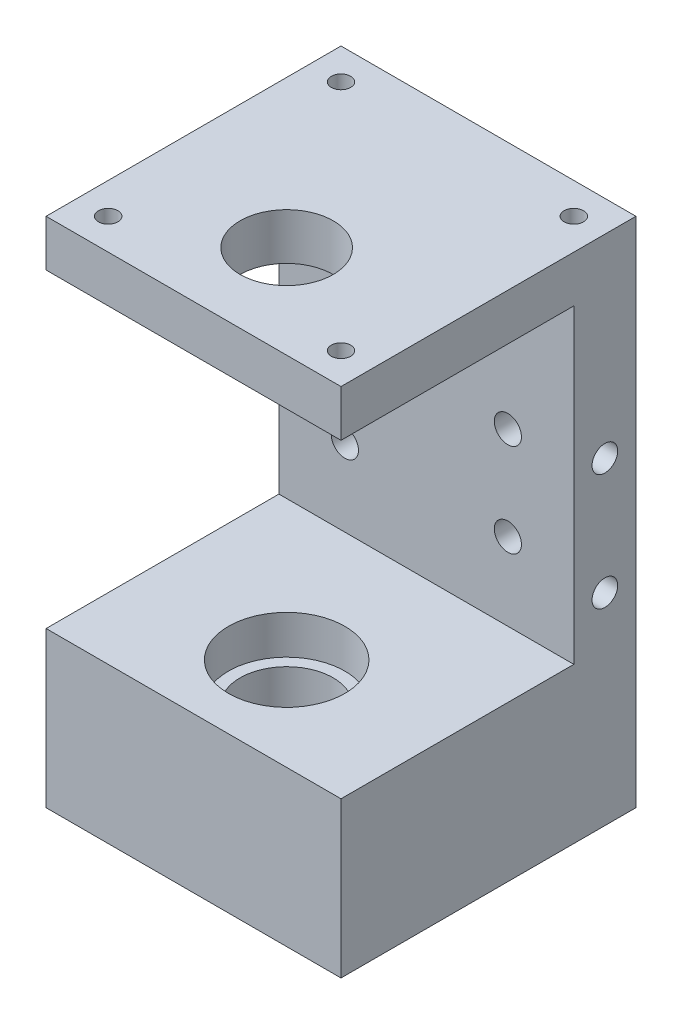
ISO-10303-21;
HEADER;
FILE_DESCRIPTION(('STEP AP214'),'2;1');
FILE_NAME('part.step','',(''),(''),'','','');
FILE_SCHEMA(('AUTOMOTIVE_DESIGN { 1 0 10303 214 1 1 1 1 }'));
ENDSEC;
DATA;
#1=APPLICATION_CONTEXT('core data for automotive mechanical design processes');
#2=APPLICATION_PROTOCOL_DEFINITION('international standard','automotive_design',2000,#1);
#3=PRODUCT_CONTEXT('',#1,'mechanical');
#4=PRODUCT('Part','Part','',(#3));
#5=PRODUCT_RELATED_PRODUCT_CATEGORY('part','',(#4));
#6=PRODUCT_DEFINITION_FORMATION('','',#4);
#7=PRODUCT_DEFINITION_CONTEXT('part definition',#1,'design');
#8=PRODUCT_DEFINITION('design','',#6,#7);
#9=PRODUCT_DEFINITION_SHAPE('','',#8);
#10=(LENGTH_UNIT() NAMED_UNIT(*) SI_UNIT(.MILLI.,.METRE.));
#11=(NAMED_UNIT(*) PLANE_ANGLE_UNIT() SI_UNIT($,.RADIAN.));
#12=(NAMED_UNIT(*) SI_UNIT($,.STERADIAN.) SOLID_ANGLE_UNIT());
#13=UNCERTAINTY_MEASURE_WITH_UNIT(LENGTH_MEASURE(1.E-05),#10,'distance_accuracy_value','');
#14=(GEOMETRIC_REPRESENTATION_CONTEXT(3) GLOBAL_UNCERTAINTY_ASSIGNED_CONTEXT((#13)) GLOBAL_UNIT_ASSIGNED_CONTEXT((#10,
#11,#12)) REPRESENTATION_CONTEXT('',''));
#15=CARTESIAN_POINT('',(0.,0.,0.));
#16=DIRECTION('',(0.,0.,1.));
#17=DIRECTION('',(1.,0.,0.));
#18=AXIS2_PLACEMENT_3D('',#15,#16,#17);
#19=CARTESIAN_POINT('',(0.,-60.,7.));
#20=DIRECTION('',(0.,1.,0.));
#21=DIRECTION('',(0.,0.,1.));
#22=AXIS2_PLACEMENT_3D('',#19,#20,#21);
#23=CYLINDRICAL_SURFACE('',#22,6.);
#24=CARTESIAN_POINT('',(0.,-45.,7.));
#25=DIRECTION('',(0.,1.,0.));
#26=DIRECTION('',(0.,0.,1.));
#27=AXIS2_PLACEMENT_3D('',#24,#25,#26);
#28=CIRCLE('',#27,6.);
#29=CARTESIAN_POINT('',(0.,-45.,13.));
#30=VERTEX_POINT('',#29);
#31=EDGE_CURVE('E20',#30,#30,#28,.F.);
#32=ORIENTED_EDGE('',*,*,#31,.F.);
#33=EDGE_LOOP('',(#32));
#34=FACE_BOUND('',#33,.T.);
#35=CARTESIAN_POINT('',(0.,-55.,7.));
#36=DIRECTION('',(0.,1.,0.));
#37=DIRECTION('',(0.,0.,1.));
#38=AXIS2_PLACEMENT_3D('',#35,#36,#37);
#39=CIRCLE('',#38,6.);
#40=CARTESIAN_POINT('',(0.,-55.,13.));
#41=VERTEX_POINT('',#40);
#42=EDGE_CURVE('E415',#41,#41,#39,.T.);
#43=ORIENTED_EDGE('',*,*,#42,.F.);
#44=EDGE_LOOP('',(#43));
#45=FACE_BOUND('',#44,.T.);
#46=ADVANCED_FACE('F17',(#34,#45),#23,.F.);
#47=CARTESIAN_POINT('',(0.,-45.,7.));
#48=DIRECTION('',(0.,1.,0.));
#49=DIRECTION('',(0.,0.,1.));
#50=AXIS2_PLACEMENT_3D('',#47,#48,#49);
#51=PLANE('',#50);
#52=ORIENTED_EDGE('',*,*,#31,.T.);
#53=EDGE_LOOP('',(#52));
#54=FACE_BOUND('',#53,.T.);
#55=CARTESIAN_POINT('',(0.,-45.,7.));
#56=DIRECTION('',(0.,1.,0.));
#57=DIRECTION('',(0.,0.,1.));
#58=AXIS2_PLACEMENT_3D('',#55,#56,#57);
#59=CIRCLE('',#58,7.5);
#60=CARTESIAN_POINT('',(0.,-45.,14.5));
#61=VERTEX_POINT('',#60);
#62=EDGE_CURVE('E413',#61,#61,#59,.T.);
#63=ORIENTED_EDGE('',*,*,#62,.T.);
#64=EDGE_LOOP('',(#63));
#65=FACE_BOUND('',#64,.T.);
#66=ADVANCED_FACE('F400',(#54,#65),#51,.T.);
#67=CARTESIAN_POINT('',(0.,-55.,7.));
#68=DIRECTION('',(0.,-1.,0.));
#69=DIRECTION('',(0.,0.,-1.));
#70=AXIS2_PLACEMENT_3D('',#67,#68,#69);
#71=PLANE('',#70);
#72=ORIENTED_EDGE('',*,*,#42,.T.);
#73=EDGE_LOOP('',(#72));
#74=FACE_BOUND('',#73,.T.);
#75=CARTESIAN_POINT('',(0.,-55.,7.));
#76=DIRECTION('',(0.,-1.,0.));
#77=DIRECTION('',(0.,0.,-1.));
#78=AXIS2_PLACEMENT_3D('',#75,#76,#77);
#79=CIRCLE('',#78,7.5);
#80=CARTESIAN_POINT('',(0.,-55.,-0.500000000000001));
#81=VERTEX_POINT('',#80);
#82=EDGE_CURVE('E276',#81,#81,#79,.T.);
#83=ORIENTED_EDGE('',*,*,#82,.T.);
#84=EDGE_LOOP('',(#83));
#85=FACE_BOUND('',#84,.T.);
#86=ADVANCED_FACE('F397',(#74,#85),#71,.T.);
#87=CARTESIAN_POINT('',(11.0000000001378,-34.,-15.));
#88=DIRECTION('',(1.,0.,0.));
#89=DIRECTION('',(0.,0.,-1.));
#90=AXIS2_PLACEMENT_3D('',#87,#88,#89);
#91=CONICAL_SURFACE('',#90,1.65000000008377,1.02974425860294);
#92=CARTESIAN_POINT('',(10.0085799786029,-34.,-15.));
#93=VERTEX_POINT('',#92);
#94=VERTEX_LOOP('',#93);
#95=FACE_BOUND('',#94,.T.);
#96=CARTESIAN_POINT('',(11.,-34.,-15.));
#97=DIRECTION('',(1.,0.,0.));
#98=DIRECTION('',(0.,0.,-1.));
#99=AXIS2_PLACEMENT_3D('',#96,#97,#98);
#100=CIRCLE('',#99,1.65);
#101=CARTESIAN_POINT('',(11.,-34.,-16.65));
#102=VERTEX_POINT('',#101);
#103=EDGE_CURVE('E274',#102,#102,#100,.T.);
#104=ORIENTED_EDGE('',*,*,#103,.T.);
#105=EDGE_LOOP('',(#104));
#106=FACE_BOUND('',#105,.T.);
#107=ADVANCED_FACE('F393',(#95,#106),#91,.F.);
#108=CARTESIAN_POINT('',(15.,-1.50000000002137,-15.));
#109=DIRECTION('',(0.,1.,0.));
#110=DIRECTION('',(-1.,0.,0.));
#111=AXIS2_PLACEMENT_3D('',#108,#109,#110);
#112=CONICAL_SURFACE('',#111,1.24999999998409,1.0297442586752);
#113=CARTESIAN_POINT('',(15.,-2.25107577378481,-14.9999999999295));
#114=VERTEX_POINT('',#113);
#115=VERTEX_LOOP('',#114);
#116=FACE_BOUND('',#115,.T.);
#117=CARTESIAN_POINT('',(15.,-1.5,-15.));
#118=DIRECTION('',(0.,1.,0.));
#119=DIRECTION('',(0.,0.,1.));
#120=AXIS2_PLACEMENT_3D('',#117,#118,#119);
#121=CIRCLE('',#120,1.25);
#122=CARTESIAN_POINT('',(15.,-1.5,-13.75));
#123=VERTEX_POINT('',#122);
#124=EDGE_CURVE('E271',#123,#123,#121,.T.);
#125=ORIENTED_EDGE('',*,*,#124,.T.);
#126=EDGE_LOOP('',(#125));
#127=FACE_BOUND('',#126,.T.);
#128=ADVANCED_FACE('F389',(#116,#127),#112,.F.);
#129=CARTESIAN_POINT('',(-15.,-1.49999999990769,-15.));
#130=DIRECTION('',(0.,1.,0.));
#131=DIRECTION('',(0.,0.,1.));
#132=AXIS2_PLACEMENT_3D('',#129,#130,#131);
#133=CONICAL_SURFACE('',#132,1.25000000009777,1.0297442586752);
#134=CARTESIAN_POINT('',(-15.,-2.25107577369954,-15.));
#135=VERTEX_POINT('',#134);
#136=VERTEX_LOOP('',#135);
#137=FACE_BOUND('',#136,.T.);
#138=CARTESIAN_POINT('',(-15.,-1.5,-15.));
#139=DIRECTION('',(0.,1.,0.));
#140=DIRECTION('',(0.,0.,1.));
#141=AXIS2_PLACEMENT_3D('',#138,#139,#140);
#142=CIRCLE('',#141,1.25);
#143=CARTESIAN_POINT('',(-15.,-1.5,-13.75));
#144=VERTEX_POINT('',#143);
#145=EDGE_CURVE('E268',#144,#144,#142,.T.);
#146=ORIENTED_EDGE('',*,*,#145,.T.);
#147=EDGE_LOOP('',(#146));
#148=FACE_BOUND('',#147,.T.);
#149=ADVANCED_FACE('F385',(#137,#148),#133,.F.);
#150=CARTESIAN_POINT('',(-11.0000000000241,-34.,-15.));
#151=DIRECTION('',(-1.,0.,0.));
#152=DIRECTION('',(0.,0.,1.));
#153=AXIS2_PLACEMENT_3D('',#150,#151,#152);
#154=CONICAL_SURFACE('',#153,1.64999999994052,1.02974425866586);
#155=CARTESIAN_POINT('',(-10.0085799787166,-34.,-15.));
#156=VERTEX_POINT('',#155);
#157=VERTEX_LOOP('',#156);
#158=FACE_BOUND('',#157,.T.);
#159=CARTESIAN_POINT('',(-11.,-34.,-15.));
#160=DIRECTION('',(-1.,0.,0.));
#161=DIRECTION('',(0.,0.,1.));
#162=AXIS2_PLACEMENT_3D('',#159,#160,#161);
#163=CIRCLE('',#162,1.65);
#164=CARTESIAN_POINT('',(-11.,-34.,-13.35));
#165=VERTEX_POINT('',#164);
#166=EDGE_CURVE('E264',#165,#165,#163,.T.);
#167=ORIENTED_EDGE('',*,*,#166,.T.);
#168=EDGE_LOOP('',(#167));
#169=FACE_BOUND('',#168,.T.);
#170=ADVANCED_FACE('F381',(#158,#169),#154,.F.);
#171=CARTESIAN_POINT('',(0.,-45.,7.));
#172=DIRECTION('',(0.,1.,0.));
#173=DIRECTION('',(0.,0.,1.));
#174=AXIS2_PLACEMENT_3D('',#171,#172,#173);
#175=CYLINDRICAL_SURFACE('',#174,7.5);
#176=CARTESIAN_POINT('',(0.,-40.,7.));
#177=DIRECTION('',(0.,1.,0.));
#178=DIRECTION('',(0.,0.,1.));
#179=AXIS2_PLACEMENT_3D('',#176,#177,#178);
#180=CIRCLE('',#179,7.5);
#181=CARTESIAN_POINT('',(0.,-40.,14.5));
#182=VERTEX_POINT('',#181);
#183=EDGE_CURVE('E259',#182,#182,#180,.F.);
#184=ORIENTED_EDGE('',*,*,#183,.F.);
#185=EDGE_LOOP('',(#184));
#186=FACE_BOUND('',#185,.T.);
#187=ORIENTED_EDGE('',*,*,#62,.F.);
#188=EDGE_LOOP('',(#187));
#189=FACE_BOUND('',#188,.T.);
#190=ADVANCED_FACE('F377',(#186,#189),#175,.F.);
#191=CARTESIAN_POINT('',(0.,-55.,7.));
#192=DIRECTION('',(0.,-1.,0.));
#193=DIRECTION('',(0.,0.,-1.));
#194=AXIS2_PLACEMENT_3D('',#191,#192,#193);
#195=CYLINDRICAL_SURFACE('',#194,7.5);
#196=ORIENTED_EDGE('',*,*,#82,.F.);
#197=EDGE_LOOP('',(#196));
#198=FACE_BOUND('',#197,.T.);
#199=CARTESIAN_POINT('',(0.,-60.,7.));
#200=DIRECTION('',(0.,-1.,0.));
#201=DIRECTION('',(0.,0.,-1.));
#202=AXIS2_PLACEMENT_3D('',#199,#200,#201);
#203=CIRCLE('',#202,7.5);
#204=CARTESIAN_POINT('',(0.,-60.,-0.500000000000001));
#205=VERTEX_POINT('',#204);
#206=EDGE_CURVE('E251',#205,#205,#203,.T.);
#207=ORIENTED_EDGE('',*,*,#206,.T.);
#208=EDGE_LOOP('',(#207));
#209=FACE_BOUND('',#208,.T.);
#210=ADVANCED_FACE('F373',(#198,#209),#195,.F.);
#211=CARTESIAN_POINT('',(19.,-34.,-15.));
#212=DIRECTION('',(1.,0.,0.));
#213=DIRECTION('',(0.,0.,-1.));
#214=AXIS2_PLACEMENT_3D('',#211,#212,#213);
#215=CYLINDRICAL_SURFACE('',#214,1.65);
#216=ORIENTED_EDGE('',*,*,#103,.F.);
#217=EDGE_LOOP('',(#216));
#218=FACE_BOUND('',#217,.T.);
#219=CARTESIAN_POINT('',(19.,-34.,-15.));
#220=DIRECTION('',(1.,0.,0.));
#221=DIRECTION('',(0.,0.,-1.));
#222=AXIS2_PLACEMENT_3D('',#219,#220,#221);
#223=CIRCLE('',#222,1.65);
#224=CARTESIAN_POINT('',(19.,-34.,-16.65));
#225=VERTEX_POINT('',#224);
#226=EDGE_CURVE('E248',#225,#225,#223,.T.);
#227=ORIENTED_EDGE('',*,*,#226,.T.);
#228=EDGE_LOOP('',(#227));
#229=FACE_BOUND('',#228,.T.);
#230=ADVANCED_FACE('F369',(#218,#229),#215,.F.);
#231=CARTESIAN_POINT('',(-15.,6.,15.));
#232=DIRECTION('',(0.,1.,0.));
#233=DIRECTION('',(0.,0.,1.));
#234=AXIS2_PLACEMENT_3D('',#231,#232,#233);
#235=CYLINDRICAL_SURFACE('',#234,1.25);
#236=CARTESIAN_POINT('',(-15.,6.,15.));
#237=DIRECTION('',(0.,1.,0.));
#238=DIRECTION('',(0.,0.,1.));
#239=AXIS2_PLACEMENT_3D('',#236,#237,#238);
#240=CIRCLE('',#239,1.25);
#241=CARTESIAN_POINT('',(-15.,6.,16.25));
#242=VERTEX_POINT('',#241);
#243=EDGE_CURVE('E229',#242,#242,#240,.F.);
#244=ORIENTED_EDGE('',*,*,#243,.F.);
#245=EDGE_LOOP('',(#244));
#246=FACE_BOUND('',#245,.T.);
#247=CARTESIAN_POINT('',(-15.,0.,15.));
#248=DIRECTION('',(0.,1.,0.));
#249=DIRECTION('',(0.,0.,1.));
#250=AXIS2_PLACEMENT_3D('',#247,#248,#249);
#251=CIRCLE('',#250,1.25);
#252=CARTESIAN_POINT('',(-15.,0.,16.25));
#253=VERTEX_POINT('',#252);
#254=EDGE_CURVE('E267',#253,#253,#251,.F.);
#255=ORIENTED_EDGE('',*,*,#254,.T.);
#256=EDGE_LOOP('',(#255));
#257=FACE_BOUND('',#256,.T.);
#258=ADVANCED_FACE('F365',(#246,#257),#235,.F.);
#259=CARTESIAN_POINT('',(15.,6.,15.));
#260=DIRECTION('',(0.,1.,0.));
#261=DIRECTION('',(0.,0.,1.));
#262=AXIS2_PLACEMENT_3D('',#259,#260,#261);
#263=CYLINDRICAL_SURFACE('',#262,1.25);
#264=CARTESIAN_POINT('',(15.,6.,15.));
#265=DIRECTION('',(0.,1.,0.));
#266=DIRECTION('',(0.,0.,1.));
#267=AXIS2_PLACEMENT_3D('',#264,#265,#266);
#268=CIRCLE('',#267,1.25);
#269=CARTESIAN_POINT('',(15.,6.,16.25));
#270=VERTEX_POINT('',#269);
#271=EDGE_CURVE('E439',#270,#270,#268,.F.);
#272=ORIENTED_EDGE('',*,*,#271,.F.);
#273=EDGE_LOOP('',(#272));
#274=FACE_BOUND('',#273,.T.);
#275=CARTESIAN_POINT('',(15.,0.,15.));
#276=DIRECTION('',(0.,1.,0.));
#277=DIRECTION('',(0.,0.,1.));
#278=AXIS2_PLACEMENT_3D('',#275,#276,#277);
#279=CIRCLE('',#278,1.25);
#280=CARTESIAN_POINT('',(15.,0.,16.25));
#281=VERTEX_POINT('',#280);
#282=EDGE_CURVE('E423',#281,#281,#279,.F.);
#283=ORIENTED_EDGE('',*,*,#282,.T.);
#284=EDGE_LOOP('',(#283));
#285=FACE_BOUND('',#284,.T.);
#286=ADVANCED_FACE('F361',(#274,#285),#263,.F.);
#287=CARTESIAN_POINT('',(15.,6.,-15.));
#288=DIRECTION('',(0.,1.,0.));
#289=DIRECTION('',(0.,0.,1.));
#290=AXIS2_PLACEMENT_3D('',#287,#288,#289);
#291=CYLINDRICAL_SURFACE('',#290,1.25);
#292=CARTESIAN_POINT('',(15.,6.,-15.));
#293=DIRECTION('',(0.,1.,0.));
#294=DIRECTION('',(0.,0.,1.));
#295=AXIS2_PLACEMENT_3D('',#292,#293,#294);
#296=CIRCLE('',#295,1.25);
#297=CARTESIAN_POINT('',(15.,6.,-13.75));
#298=VERTEX_POINT('',#297);
#299=EDGE_CURVE('E442',#298,#298,#296,.F.);
#300=ORIENTED_EDGE('',*,*,#299,.F.);
#301=EDGE_LOOP('',(#300));
#302=FACE_BOUND('',#301,.T.);
#303=ORIENTED_EDGE('',*,*,#124,.F.);
#304=EDGE_LOOP('',(#303));
#305=FACE_BOUND('',#304,.T.);
#306=ADVANCED_FACE('F357',(#302,#305),#291,.F.);
#307=CARTESIAN_POINT('',(-15.,6.,-15.));
#308=DIRECTION('',(0.,1.,0.));
#309=DIRECTION('',(0.,0.,1.));
#310=AXIS2_PLACEMENT_3D('',#307,#308,#309);
#311=CYLINDRICAL_SURFACE('',#310,1.25);
#312=CARTESIAN_POINT('',(-15.,6.,-15.));
#313=DIRECTION('',(0.,1.,0.));
#314=DIRECTION('',(0.,0.,1.));
#315=AXIS2_PLACEMENT_3D('',#312,#313,#314);
#316=CIRCLE('',#315,1.25);
#317=CARTESIAN_POINT('',(-15.,6.,-13.75));
#318=VERTEX_POINT('',#317);
#319=EDGE_CURVE('E445',#318,#318,#316,.F.);
#320=ORIENTED_EDGE('',*,*,#319,.F.);
#321=EDGE_LOOP('',(#320));
#322=FACE_BOUND('',#321,.T.);
#323=ORIENTED_EDGE('',*,*,#145,.F.);
#324=EDGE_LOOP('',(#323));
#325=FACE_BOUND('',#324,.T.);
#326=ADVANCED_FACE('F353',(#322,#325),#311,.F.);
#327=CARTESIAN_POINT('',(0.,-60.,7.));
#328=DIRECTION('',(0.,1.,0.));
#329=DIRECTION('',(0.,0.,1.));
#330=AXIS2_PLACEMENT_3D('',#327,#328,#329);
#331=CYLINDRICAL_SURFACE('',#330,6.);
#332=CARTESIAN_POINT('',(0.,6.00000000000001,7.));
#333=DIRECTION('',(0.,1.,0.));
#334=DIRECTION('',(0.,0.,1.));
#335=AXIS2_PLACEMENT_3D('',#332,#333,#334);
#336=CIRCLE('',#335,6.);
#337=CARTESIAN_POINT('',(0.,6.00000000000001,13.));
#338=VERTEX_POINT('',#337);
#339=EDGE_CURVE('E448',#338,#338,#336,.F.);
#340=ORIENTED_EDGE('',*,*,#339,.F.);
#341=EDGE_LOOP('',(#340));
#342=FACE_BOUND('',#341,.T.);
#343=CARTESIAN_POINT('',(0.,0.,7.));
#344=DIRECTION('',(0.,1.,0.));
#345=DIRECTION('',(0.,0.,1.));
#346=AXIS2_PLACEMENT_3D('',#343,#344,#345);
#347=CIRCLE('',#346,6.);
#348=CARTESIAN_POINT('',(0.,0.,13.));
#349=VERTEX_POINT('',#348);
#350=EDGE_CURVE('E263',#349,#349,#347,.F.);
#351=ORIENTED_EDGE('',*,*,#350,.T.);
#352=EDGE_LOOP('',(#351));
#353=FACE_BOUND('',#352,.T.);
#354=ADVANCED_FACE('F349',(#342,#353),#331,.F.);
#355=CARTESIAN_POINT('',(-19.,-34.,-15.));
#356=DIRECTION('',(-1.,0.,0.));
#357=DIRECTION('',(0.,0.,1.));
#358=AXIS2_PLACEMENT_3D('',#355,#356,#357);
#359=CYLINDRICAL_SURFACE('',#358,1.65);
#360=ORIENTED_EDGE('',*,*,#166,.F.);
#361=EDGE_LOOP('',(#360));
#362=FACE_BOUND('',#361,.T.);
#363=CARTESIAN_POINT('',(-19.,-34.,-15.));
#364=DIRECTION('',(-1.,0.,0.));
#365=DIRECTION('',(0.,0.,1.));
#366=AXIS2_PLACEMENT_3D('',#363,#364,#365);
#367=CIRCLE('',#366,1.65);
#368=CARTESIAN_POINT('',(-19.,-34.,-13.35));
#369=VERTEX_POINT('',#368);
#370=EDGE_CURVE('E227',#369,#369,#367,.T.);
#371=ORIENTED_EDGE('',*,*,#370,.T.);
#372=EDGE_LOOP('',(#371));
#373=FACE_BOUND('',#372,.T.);
#374=ADVANCED_FACE('F346',(#362,#373),#359,.F.);
#375=CARTESIAN_POINT('',(-19.,6.,19.));
#376=DIRECTION('',(0.,0.,-1.));
#377=DIRECTION('',(-1.,0.,0.));
#378=AXIS2_PLACEMENT_3D('',#375,#376,#377);
#379=PLANE('',#378);
#380=DIRECTION('',(0.,1.,0.));
#381=VECTOR('',#380,1.);
#382=CARTESIAN_POINT('',(19.,6.,19.));
#383=LINE('',#382,#381);
#384=CARTESIAN_POINT('',(19.,0.,19.));
#385=VERTEX_POINT('',#384);
#386=CARTESIAN_POINT('',(19.,6.,19.));
#387=VERTEX_POINT('',#386);
#388=EDGE_CURVE('E245',#385,#387,#383,.T.);
#389=ORIENTED_EDGE('',*,*,#388,.T.);
#390=DIRECTION('',(1.,0.,0.));
#391=VECTOR('',#390,1.);
#392=CARTESIAN_POINT('',(0.,6.,19.));
#393=LINE('',#392,#391);
#394=CARTESIAN_POINT('',(-19.,6.,19.));
#395=VERTEX_POINT('',#394);
#396=EDGE_CURVE('E230',#395,#387,#393,.T.);
#397=ORIENTED_EDGE('',*,*,#396,.F.);
#398=DIRECTION('',(0.,1.,0.));
#399=VECTOR('',#398,1.);
#400=CARTESIAN_POINT('',(-19.,6.,19.));
#401=LINE('',#400,#399);
#402=CARTESIAN_POINT('',(-19.,0.,19.));
#403=VERTEX_POINT('',#402);
#404=EDGE_CURVE('E223',#395,#403,#401,.F.);
#405=ORIENTED_EDGE('',*,*,#404,.T.);
#406=DIRECTION('',(1.,0.,0.));
#407=VECTOR('',#406,1.);
#408=CARTESIAN_POINT('',(0.,0.,19.));
#409=LINE('',#408,#407);
#410=EDGE_CURVE('E260',#403,#385,#409,.T.);
#411=ORIENTED_EDGE('',*,*,#410,.T.);
#412=EDGE_LOOP('',(#389,#397,#405,#411));
#413=FACE_BOUND('',#412,.T.);
#414=ADVANCED_FACE('F299',(#413),#379,.F.);
#415=CARTESIAN_POINT('',(0.,0.,0.));
#416=DIRECTION('',(0.,1.,0.));
#417=DIRECTION('',(0.,0.,1.));
#418=AXIS2_PLACEMENT_3D('',#415,#416,#417);
#419=PLANE('',#418);
#420=DIRECTION('',(1.,0.,0.));
#421=VECTOR('',#420,1.);
#422=CARTESIAN_POINT('',(-19.,0.,-11.));
#423=LINE('',#422,#421);
#424=CARTESIAN_POINT('',(19.,0.,-11.));
#425=VERTEX_POINT('',#424);
#426=CARTESIAN_POINT('',(-19.,0.,-11.));
#427=VERTEX_POINT('',#426);
#428=EDGE_CURVE('E118',#425,#427,#423,.F.);
#429=ORIENTED_EDGE('',*,*,#428,.F.);
#430=DIRECTION('',(0.,0.,1.));
#431=VECTOR('',#430,1.);
#432=CARTESIAN_POINT('',(19.,0.,-19.));
#433=LINE('',#432,#431);
#434=EDGE_CURVE('E232',#425,#385,#433,.T.);
#435=ORIENTED_EDGE('',*,*,#434,.T.);
#436=ORIENTED_EDGE('',*,*,#410,.F.);
#437=DIRECTION('',(0.,0.,-1.));
#438=VECTOR('',#437,1.);
#439=CARTESIAN_POINT('',(-19.,0.,-19.));
#440=LINE('',#439,#438);
#441=EDGE_CURVE('E220',#403,#427,#440,.T.);
#442=ORIENTED_EDGE('',*,*,#441,.T.);
#443=EDGE_LOOP('',(#429,#435,#436,#442));
#444=FACE_BOUND('',#443,.T.);
#445=ORIENTED_EDGE('',*,*,#350,.F.);
#446=EDGE_LOOP('',(#445));
#447=FACE_BOUND('',#446,.T.);
#448=ORIENTED_EDGE('',*,*,#282,.F.);
#449=EDGE_LOOP('',(#448));
#450=FACE_BOUND('',#449,.T.);
#451=ORIENTED_EDGE('',*,*,#254,.F.);
#452=EDGE_LOOP('',(#451));
#453=FACE_BOUND('',#452,.T.);
#454=ADVANCED_FACE('F296',(#444,#447,#450,#453),#419,.F.);
#455=CARTESIAN_POINT('',(0.,-40.,0.));
#456=DIRECTION('',(0.,1.,0.));
#457=DIRECTION('',(0.,0.,1.));
#458=AXIS2_PLACEMENT_3D('',#455,#456,#457);
#459=PLANE('',#458);
#460=DIRECTION('',(-1.,0.,0.));
#461=VECTOR('',#460,1.);
#462=CARTESIAN_POINT('',(-19.,-40.,19.));
#463=LINE('',#462,#461);
#464=CARTESIAN_POINT('',(-19.,-40.,19.));
#465=VERTEX_POINT('',#464);
#466=CARTESIAN_POINT('',(19.,-40.,19.));
#467=VERTEX_POINT('',#466);
#468=EDGE_CURVE('E257',#465,#467,#463,.F.);
#469=ORIENTED_EDGE('',*,*,#468,.T.);
#470=DIRECTION('',(0.,0.,1.));
#471=VECTOR('',#470,1.);
#472=CARTESIAN_POINT('',(19.,-40.,-19.));
#473=LINE('',#472,#471);
#474=CARTESIAN_POINT('',(19.,-40.,-11.));
#475=VERTEX_POINT('',#474);
#476=EDGE_CURVE('E238',#467,#475,#473,.F.);
#477=ORIENTED_EDGE('',*,*,#476,.T.);
#478=DIRECTION('',(1.,0.,0.));
#479=VECTOR('',#478,1.);
#480=CARTESIAN_POINT('',(-19.,-40.,-11.));
#481=LINE('',#480,#479);
#482=CARTESIAN_POINT('',(-19.,-40.,-11.));
#483=VERTEX_POINT('',#482);
#484=EDGE_CURVE('E252',#483,#475,#481,.T.);
#485=ORIENTED_EDGE('',*,*,#484,.F.);
#486=DIRECTION('',(0.,0.,-1.));
#487=VECTOR('',#486,1.);
#488=CARTESIAN_POINT('',(-19.,-40.,-19.));
#489=LINE('',#488,#487);
#490=EDGE_CURVE('E214',#483,#465,#489,.F.);
#491=ORIENTED_EDGE('',*,*,#490,.T.);
#492=EDGE_LOOP('',(#469,#477,#485,#491));
#493=FACE_BOUND('',#492,.T.);
#494=ORIENTED_EDGE('',*,*,#183,.T.);
#495=EDGE_LOOP('',(#494));
#496=FACE_BOUND('',#495,.T.);
#497=ADVANCED_FACE('F290',(#493,#496),#459,.T.);
#498=CARTESIAN_POINT('',(-19.,-60.,19.));
#499=DIRECTION('',(0.,0.,-1.));
#500=DIRECTION('',(-1.,0.,0.));
#501=AXIS2_PLACEMENT_3D('',#498,#499,#500);
#502=PLANE('',#501);
#503=DIRECTION('',(0.,1.,0.));
#504=VECTOR('',#503,1.);
#505=CARTESIAN_POINT('',(-19.,6.,19.));
#506=LINE('',#505,#504);
#507=CARTESIAN_POINT('',(-19.,-60.,19.));
#508=VERTEX_POINT('',#507);
#509=EDGE_CURVE('E211',#465,#508,#506,.F.);
#510=ORIENTED_EDGE('',*,*,#509,.T.);
#511=DIRECTION('',(1.,0.,0.));
#512=VECTOR('',#511,1.);
#513=CARTESIAN_POINT('',(0.,-60.,19.));
#514=LINE('',#513,#512);
#515=CARTESIAN_POINT('',(19.,-60.,19.));
#516=VERTEX_POINT('',#515);
#517=EDGE_CURVE('E249',#508,#516,#514,.T.);
#518=ORIENTED_EDGE('',*,*,#517,.T.);
#519=DIRECTION('',(0.,1.,0.));
#520=VECTOR('',#519,1.);
#521=CARTESIAN_POINT('',(19.,6.,19.));
#522=LINE('',#521,#520);
#523=EDGE_CURVE('E241',#516,#467,#522,.T.);
#524=ORIENTED_EDGE('',*,*,#523,.T.);
#525=ORIENTED_EDGE('',*,*,#468,.F.);
#526=EDGE_LOOP('',(#510,#518,#524,#525));
#527=FACE_BOUND('',#526,.T.);
#528=ADVANCED_FACE('F287',(#527),#502,.F.);
#529=CARTESIAN_POINT('',(-10.9999999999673,-19.,-15.));
#530=DIRECTION('',(-1.,0.,0.));
#531=DIRECTION('',(0.,0.,1.));
#532=AXIS2_PLACEMENT_3D('',#529,#530,#531);
#533=CONICAL_SURFACE('',#532,1.64999999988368,1.02974425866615);
#534=CARTESIAN_POINT('',(-11.0000000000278,-19.6770509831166,-13.4953066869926));
#535=CARTESIAN_POINT('',(-10.9653855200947,-19.6873833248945,-13.5632052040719));
#536=CARTESIAN_POINT('',(-10.9309774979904,-19.6964625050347,-13.6314013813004));
#537=CARTESIAN_POINT('',(-10.8630168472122,-19.7122869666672,-13.7685687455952));
#538=CARTESIAN_POINT('',(-10.8294650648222,-19.7190300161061,-13.8375406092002));
#539=CARTESIAN_POINT('',(-10.7620519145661,-19.7306236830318,-13.9798464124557));
#540=CARTESIAN_POINT('',(-10.7282619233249,-19.7353603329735,-14.0532235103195));
#541=CARTESIAN_POINT('',(-10.6632343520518,-19.7426751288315,-14.2011935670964));
#542=CARTESIAN_POINT('',(-10.6319956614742,-19.7452542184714,-14.2757859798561));
#543=CARTESIAN_POINT('',(-10.586195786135,-19.7479584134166,-14.3951771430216));
#544=CARTESIAN_POINT('',(-10.570126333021,-19.7486588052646,-14.4393800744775));
#545=CARTESIAN_POINT('',(-10.540193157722,-19.7496021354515,-14.5285587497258));
#546=CARTESIAN_POINT('',(-10.5263300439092,-19.7498449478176,-14.5735347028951));
#547=CARTESIAN_POINT('',(-10.5019676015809,-19.7500406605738,-14.6634366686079));
#548=CARTESIAN_POINT('',(-10.491405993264,-19.7499993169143,-14.7083453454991));
#549=CARTESIAN_POINT('',(-10.4743331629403,-19.7498329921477,-14.7989076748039));
#550=CARTESIAN_POINT('',(-10.4678177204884,-19.7497080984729,-14.8445604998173));
#551=CARTESIAN_POINT('',(-10.4596732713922,-19.7495407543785,-14.9372298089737));
#552=CARTESIAN_POINT('',(-10.4581428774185,-19.7494999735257,-14.9842554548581));
#553=CARTESIAN_POINT('',(-10.460520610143,-19.7495548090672,-15.0781654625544));
#554=CARTESIAN_POINT('',(-10.4644293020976,-19.7496504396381,-15.1250498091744));
#555=CARTESIAN_POINT('',(-10.4771583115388,-19.7498620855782,-15.2191364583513));
#556=CARTESIAN_POINT('',(-10.4860819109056,-19.7499784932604,-15.2663241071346));
#557=CARTESIAN_POINT('',(-10.5077379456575,-19.750016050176,-15.3598191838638));
#558=CARTESIAN_POINT('',(-10.5204730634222,-19.7499370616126,-15.4061259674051));
#559=CARTESIAN_POINT('',(-10.5491448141,-19.7493705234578,-15.4994819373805));
#560=CARTESIAN_POINT('',(-10.5651774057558,-19.7488688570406,-15.5465009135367));
#561=CARTESIAN_POINT('',(-10.5992540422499,-19.7472664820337,-15.6398011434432));
#562=CARTESIAN_POINT('',(-10.6172987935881,-19.746165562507,-15.686082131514));
#563=CARTESIAN_POINT('',(-10.6548048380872,-19.743241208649,-15.778097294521));
#564=CARTESIAN_POINT('',(-10.6742676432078,-19.7414169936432,-15.8238308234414));
#565=CARTESIAN_POINT('',(-10.7141869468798,-19.7369595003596,-15.9148237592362));
#566=CARTESIAN_POINT('',(-10.7346435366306,-19.7343261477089,-15.9600831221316));
#567=CARTESIAN_POINT('',(-10.7944985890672,-19.7254923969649,-16.0897138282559));
#568=CARTESIAN_POINT('',(-10.834786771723,-19.7181883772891,-16.1736033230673));
#569=CARTESIAN_POINT('',(-10.8961742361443,-19.7046952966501,-16.2985056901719));
#570=CARTESIAN_POINT('',(-10.9167608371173,-19.6997850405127,-16.3399162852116));
#571=CARTESIAN_POINT('',(-10.9581993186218,-19.6890856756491,-16.4224877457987));
#572=CARTESIAN_POINT('',(-10.9790511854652,-19.6832966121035,-16.4636486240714));
#573=CARTESIAN_POINT('',(-11.0000000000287,-19.6770509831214,-16.5046933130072));
#574=B_SPLINE_CURVE_WITH_KNOTS('',3,(#534,#535,#536,#537,#538,#539,#540,#541,#542,#543,#544,
#545,#546,#547,#548,#549,#550,#551,#552,#553,#554,#555,#556,#557,#558,#559,#560,#561,#562,#563,
#564,#565,#566,#567,#568,#569,#570,#571,#572,#573),.UNSPECIFIED.,.F.,.F.,(4,2,2,2,2,2,2,2,2,2,2,
2,2,2,2,2,2,2,2,4),(0.,0.230721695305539,0.461663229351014,0.704375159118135,0.946980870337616,
1.08805472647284,1.22916741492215,1.36743022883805,1.50554858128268,1.64638306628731,
1.78723218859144,1.9310943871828,2.07505806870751,2.22402974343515,2.37305389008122,
2.52223932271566,2.67143847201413,2.95138430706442,3.09089317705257,3.23039487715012),.UNSPECIFIED.);
#575=CARTESIAN_POINT('',(-11.0000000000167,-19.6770509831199,-13.4953066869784));
#576=VERTEX_POINT('',#575);
#577=CARTESIAN_POINT('',(-11.0000000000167,-19.6770509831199,-16.5046933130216));
#578=VERTEX_POINT('',#577);
#579=EDGE_CURVE('E210',#576,#578,#574,.T.);
#580=ORIENTED_EDGE('',*,*,#579,.T.);
#581=CARTESIAN_POINT('',(-11.0000000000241,-19.,-15.));
#582=DIRECTION('',(-1.,0.,0.));
#583=DIRECTION('',(0.,0.,1.));
#584=AXIS2_PLACEMENT_3D('',#581,#582,#583);
#585=CIRCLE('',#584,1.64999999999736);
#586=EDGE_CURVE('E119',#576,#578,#585,.F.);
#587=ORIENTED_EDGE('',*,*,#586,.F.);
#588=EDGE_LOOP('',(#580,#587));
#589=FACE_BOUND('',#588,.T.);
#590=ADVANCED_FACE('F332',(#589),#533,.F.);
#591=CARTESIAN_POINT('',(-19.,-19.,-15.));
#592=DIRECTION('',(-1.,0.,0.));
#593=DIRECTION('',(0.,0.,1.));
#594=AXIS2_PLACEMENT_3D('',#591,#592,#593);
#595=CYLINDRICAL_SURFACE('',#594,1.65);
#596=CARTESIAN_POINT('',(-11.0000000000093,-19.6770509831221,-16.5046933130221));
#597=CARTESIAN_POINT('',(-11.0471645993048,-19.662986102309,-16.5110138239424));
#598=CARTESIAN_POINT('',(-11.0936220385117,-19.6469710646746,-16.5179913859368));
#599=CARTESIAN_POINT('',(-11.1849088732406,-19.6111508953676,-16.532767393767));
#600=CARTESIAN_POINT('',(-11.2297385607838,-19.5913464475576,-16.5405656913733));
#601=CARTESIAN_POINT('',(-11.3619664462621,-19.5261710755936,-16.5645422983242));
#602=CARTESIAN_POINT('',(-11.4465880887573,-19.4751925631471,-16.5812232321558));
#603=CARTESIAN_POINT('',(-11.6054408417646,-19.360151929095,-16.6112992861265));
#604=CARTESIAN_POINT('',(-11.6797860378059,-19.2962568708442,-16.6247319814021));
#605=CARTESIAN_POINT('',(-11.8170496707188,-19.1564583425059,-16.6440673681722));
#606=CARTESIAN_POINT('',(-11.8800102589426,-19.0806012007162,-16.6499983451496));
#607=CARTESIAN_POINT('',(-11.9778618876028,-18.9400898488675,-16.6500012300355));
#608=CARTESIAN_POINT('',(-12.0158095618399,-18.8775586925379,-16.6467266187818));
#609=CARTESIAN_POINT('',(-12.0832946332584,-18.7489569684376,-16.632070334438));
#610=CARTESIAN_POINT('',(-12.1128342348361,-18.6828873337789,-16.6206907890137));
#611=CARTESIAN_POINT('',(-12.1630739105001,-18.549356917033,-16.5887563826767));
#612=CARTESIAN_POINT('',(-12.1837462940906,-18.4818924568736,-16.5681731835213));
#613=CARTESIAN_POINT('',(-12.2163341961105,-18.3484404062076,-16.5175809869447));
#614=CARTESIAN_POINT('',(-12.2282557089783,-18.2824518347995,-16.4875784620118));
#615=CARTESIAN_POINT('',(-12.2411021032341,-18.1803966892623,-16.4326990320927));
#616=CARTESIAN_POINT('',(-12.2445262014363,-18.1430533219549,-16.4106819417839));
#617=CARTESIAN_POINT('',(-12.2489753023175,-18.0701302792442,-16.3637165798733));
#618=CARTESIAN_POINT('',(-12.2500010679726,-18.0345500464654,-16.3387692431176));
#619=CARTESIAN_POINT('',(-12.2499977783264,-17.9281265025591,-16.2576694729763));
#620=CARTESIAN_POINT('',(-12.2455519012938,-17.8607111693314,-16.1969202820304));
#621=CARTESIAN_POINT('',(-12.231238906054,-17.7368887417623,-16.0654842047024));
#622=CARTESIAN_POINT('',(-12.221356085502,-17.6805141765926,-15.9947689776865));
#623=CARTESIAN_POINT('',(-12.1997110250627,-17.580364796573,-15.845670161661));
#624=CARTESIAN_POINT('',(-12.1879576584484,-17.5365331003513,-15.7673234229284));
#625=CARTESIAN_POINT('',(-12.1657380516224,-17.462105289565,-15.6044741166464));
#626=CARTESIAN_POINT('',(-12.1552707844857,-17.4314985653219,-15.5199765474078));
#627=CARTESIAN_POINT('',(-12.1379865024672,-17.3834029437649,-15.3432497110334));
#628=CARTESIAN_POINT('',(-12.1313316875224,-17.3664857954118,-15.250846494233));
#629=CARTESIAN_POINT('',(-12.1242766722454,-17.3485962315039,-15.0642946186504));
#630=CARTESIAN_POINT('',(-12.1238729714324,-17.3476148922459,-14.9701469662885));
#631=CARTESIAN_POINT('',(-12.1292278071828,-17.3611309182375,-14.7896750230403));
#632=CARTESIAN_POINT('',(-12.1345668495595,-17.3745744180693,-14.703255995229));
#633=CARTESIAN_POINT('',(-12.1493947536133,-17.4148074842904,-14.5338996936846));
#634=CARTESIAN_POINT('',(-12.1588874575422,-17.441609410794,-14.4509657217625));
#635=CARTESIAN_POINT('',(-12.1799783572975,-17.5086403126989,-14.2884674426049));
#636=CARTESIAN_POINT('',(-12.1916248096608,-17.5491997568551,-14.2090464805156));
#637=CARTESIAN_POINT('',(-12.2137878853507,-17.642614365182,-14.0577218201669));
#638=CARTESIAN_POINT('',(-12.2243061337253,-17.6954514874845,-13.9858073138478));
#639=CARTESIAN_POINT('',(-12.2378373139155,-17.7907022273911,-13.8760500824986));
#640=CARTESIAN_POINT('',(-12.2421874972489,-17.8297638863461,-13.8354294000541));
#641=CARTESIAN_POINT('',(-12.2482696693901,-17.9119557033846,-13.7582934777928));
#642=CARTESIAN_POINT('',(-12.2500016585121,-17.95508586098,-13.7217782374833));
#643=CARTESIAN_POINT('',(-12.2499978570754,-18.0580325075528,-13.6433463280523));
#644=CARTESIAN_POINT('',(-12.2471014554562,-18.1190433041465,-13.6029670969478));
#645=CARTESIAN_POINT('',(-12.2338825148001,-18.2453062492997,-13.530912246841));
#646=CARTESIAN_POINT('',(-12.2235588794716,-18.3105590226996,-13.4992379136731));
#647=CARTESIAN_POINT('',(-12.1943148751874,-18.4431909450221,-13.4451343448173));
#648=CARTESIAN_POINT('',(-12.1753700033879,-18.5105756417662,-13.422731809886));
#649=CARTESIAN_POINT('',(-12.1284925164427,-18.6446267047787,-13.3872341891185));
#650=CARTESIAN_POINT('',(-12.1005658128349,-18.7112935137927,-13.3741329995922));
#651=CARTESIAN_POINT('',(-12.0492311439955,-18.815019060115,-13.3599343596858));
#652=CARTESIAN_POINT('',(-12.0285812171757,-18.8531239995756,-13.356123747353));
#653=CARTESIAN_POINT('',(-11.9844480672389,-18.9277899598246,-13.351156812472));
#654=CARTESIAN_POINT('',(-11.9609670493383,-18.9643521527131,-13.3499984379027));
#655=CARTESIAN_POINT('',(-11.8826144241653,-19.0768575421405,-13.3500033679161));
#656=CARTESIAN_POINT('',(-11.8228343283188,-19.149464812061,-13.3553986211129));
#657=CARTESIAN_POINT('',(-11.6927697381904,-19.2839971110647,-13.3731932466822));
#658=CARTESIAN_POINT('',(-11.6224312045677,-19.3458634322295,-13.3856296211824));
#659=CARTESIAN_POINT('',(-11.4651781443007,-19.4634038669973,-13.415132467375));
#660=CARTESIAN_POINT('',(-11.3772950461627,-19.5177039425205,-13.4325522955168));
#661=CARTESIAN_POINT('',(-11.2396479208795,-19.5868344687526,-13.4576887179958));
#662=CARTESIAN_POINT('',(-11.1929420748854,-19.6077806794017,-13.4658791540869));
#663=CARTESIAN_POINT('',(-11.0977493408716,-19.6455431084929,-13.4813877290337));
#664=CARTESIAN_POINT('',(-11.0492623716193,-19.6623591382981,-13.4887058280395));
#665=CARTESIAN_POINT('',(-11.0000000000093,-19.6770509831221,-13.4953066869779));
#666=B_SPLINE_CURVE_WITH_KNOTS('',3,(#596,#597,#598,#599,#600,#601,#602,#603,#604,#605,#606,
#607,#608,#609,#610,#611,#612,#613,#614,#615,#616,#617,#618,#619,#620,#621,#622,#623,#624,#625,
#626,#627,#628,#629,#630,#631,#632,#633,#634,#635,#636,#637,#638,#639,#640,#641,#642,#643,#644,
#645,#646,#647,#648,#649,#650,#651,#652,#653,#654,#655,#656,#657,#658,#659,#660,#661,#662,#663,
#664,#665),.UNSPECIFIED.,.F.,.F.,(4,2,2,2,2,2,2,2,2,2,2,2,2,2,2,2,2,2,2,2,2,2,2,2,2,2,2,2,2,2,2,
2,2,2,4),(0.,0.148751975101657,0.297477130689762,0.596538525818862,0.891954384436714,
1.18625301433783,1.40500255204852,1.62369468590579,1.8430648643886,2.06228463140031,
2.19255452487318,2.32278297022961,2.59369357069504,2.86539072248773,3.13583547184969,
3.40606285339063,3.68706573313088,3.96791125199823,4.22955218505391,4.49143565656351,
4.76011686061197,5.02840571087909,5.19765958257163,5.36691343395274,5.58560237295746,
5.80432359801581,6.02367038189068,6.24287309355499,6.37320855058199,6.50344313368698,
6.78423175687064,7.06650984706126,7.37903763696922,7.53438346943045,7.68973639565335),.UNSPECIFIED.);
#667=EDGE_CURVE('E319',#578,#576,#666,.T.);
#668=ORIENTED_EDGE('',*,*,#667,.T.);
#669=ORIENTED_EDGE('',*,*,#586,.T.);
#670=EDGE_LOOP('',(#668,#669));
#671=FACE_BOUND('',#670,.T.);
#672=CARTESIAN_POINT('',(-19.,-19.,-15.));
#673=DIRECTION('',(-1.,0.,0.));
#674=DIRECTION('',(0.,0.,1.));
#675=AXIS2_PLACEMENT_3D('',#672,#673,#674);
#676=CIRCLE('',#675,1.65);
#677=CARTESIAN_POINT('',(-19.,-19.,-13.35));
#678=VERTEX_POINT('',#677);
#679=EDGE_CURVE('E449',#678,#678,#676,.T.);
#680=ORIENTED_EDGE('',*,*,#679,.T.);
#681=EDGE_LOOP('',(#680));
#682=FACE_BOUND('',#681,.T.);
#683=ADVANCED_FACE('F166',(#671,#682),#595,.F.);
#684=CARTESIAN_POINT('',(10.9999999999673,-19.,-15.));
#685=DIRECTION('',(1.,0.,0.));
#686=DIRECTION('',(0.,0.,-1.));
#687=AXIS2_PLACEMENT_3D('',#684,#685,#686);
#688=CONICAL_SURFACE('',#687,1.64999999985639,1.02974425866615);
#689=CARTESIAN_POINT('',(11.0000000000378,-19.6770509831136,-16.5046933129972));
#690=CARTESIAN_POINT('',(10.965385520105,-19.6873833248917,-16.4367947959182));
#691=CARTESIAN_POINT('',(10.9309774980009,-19.696462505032,-16.36859861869));
#692=CARTESIAN_POINT('',(10.8630168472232,-19.7122869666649,-16.2314312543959));
#693=CARTESIAN_POINT('',(10.8294650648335,-19.7190300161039,-16.1624593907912));
#694=CARTESIAN_POINT('',(10.762051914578,-19.73062368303,-16.0201535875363));
#695=CARTESIAN_POINT('',(10.728261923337,-19.7353603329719,-15.9467764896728));
#696=CARTESIAN_POINT('',(10.6632343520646,-19.7426751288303,-15.7988064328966));
#697=CARTESIAN_POINT('',(10.6319956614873,-19.7452542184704,-15.7242140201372));
#698=CARTESIAN_POINT('',(10.5861957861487,-19.7479584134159,-15.604822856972));
#699=CARTESIAN_POINT('',(10.5701263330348,-19.7486588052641,-15.5606199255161));
#700=CARTESIAN_POINT('',(10.5401931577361,-19.7496021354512,-15.4714412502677));
#701=CARTESIAN_POINT('',(10.5263300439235,-19.7498449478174,-15.4264652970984));
#702=CARTESIAN_POINT('',(10.5019676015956,-19.7500406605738,-15.3365633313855));
#703=CARTESIAN_POINT('',(10.491405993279,-19.7499993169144,-15.2916546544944));
#704=CARTESIAN_POINT('',(10.4743331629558,-19.7498329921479,-15.2010923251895));
#705=CARTESIAN_POINT('',(10.4678177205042,-19.7497080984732,-15.1554395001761));
#706=CARTESIAN_POINT('',(10.4596732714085,-19.7495407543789,-15.0627701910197));
#707=CARTESIAN_POINT('',(10.458142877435,-19.7494999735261,-15.0157445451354));
#708=CARTESIAN_POINT('',(10.46052061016,-19.7495548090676,-14.9218345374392));
#709=CARTESIAN_POINT('',(10.4644293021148,-19.7496504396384,-14.8749501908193));
#710=CARTESIAN_POINT('',(10.4771583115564,-19.7498620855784,-14.7808635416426));
#711=CARTESIAN_POINT('',(10.4860819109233,-19.7499784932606,-14.7336758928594));
#712=CARTESIAN_POINT('',(10.5077379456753,-19.7500160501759,-14.6401808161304));
#713=CARTESIAN_POINT('',(10.5204730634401,-19.7499370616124,-14.5938740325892));
#714=CARTESIAN_POINT('',(10.5491448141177,-19.7493705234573,-14.5005180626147));
#715=CARTESIAN_POINT('',(10.5651774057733,-19.7488688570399,-14.4534990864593));
#716=CARTESIAN_POINT('',(10.5992540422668,-19.7472664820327,-14.3601988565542));
#717=CARTESIAN_POINT('',(10.6172987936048,-19.7461655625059,-14.3139178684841));
#718=CARTESIAN_POINT('',(10.6548048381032,-19.7432412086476,-14.2219027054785));
#719=CARTESIAN_POINT('',(10.6742676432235,-19.7414169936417,-14.1761691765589));
#720=CARTESIAN_POINT('',(10.7141869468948,-19.7369595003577,-14.0851762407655));
#721=CARTESIAN_POINT('',(10.7346435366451,-19.7343261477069,-14.0399168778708));
#722=CARTESIAN_POINT('',(10.7944985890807,-19.7254923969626,-13.9102861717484));
#723=CARTESIAN_POINT('',(10.8347867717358,-19.7181883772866,-13.8263966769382));
#724=CARTESIAN_POINT('',(10.8961742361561,-19.7046952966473,-13.7014943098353));
#725=CARTESIAN_POINT('',(10.9167608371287,-19.6997850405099,-13.6600837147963));
#726=CARTESIAN_POINT('',(10.9581993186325,-19.6890856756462,-13.5775122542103));
#727=CARTESIAN_POINT('',(10.9790511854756,-19.6832966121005,-13.5363513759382));
#728=CARTESIAN_POINT('',(11.0000000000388,-19.6770509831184,-13.495306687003));
#729=B_SPLINE_CURVE_WITH_KNOTS('',3,(#689,#690,#691,#692,#693,#694,#695,#696,#697,#698,#699,
#700,#701,#702,#703,#704,#705,#706,#707,#708,#709,#710,#711,#712,#713,#714,#715,#716,#717,#718,
#719,#720,#721,#722,#723,#724,#725,#726,#727,#728),.UNSPECIFIED.,.F.,.F.,(4,2,2,2,2,2,2,2,2,2,2,
2,2,2,2,2,2,2,2,4),(0.,0.230721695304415,0.461663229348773,0.704375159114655,0.946980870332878,
1.08805472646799,1.2291674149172,1.36743022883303,1.50554858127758,1.64638306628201,
1.78723218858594,1.93109438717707,2.07505806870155,2.22402974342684,2.37305389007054,
2.52223932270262,2.67143847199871,2.95138430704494,3.09089317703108,3.23039487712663),.UNSPECIFIED.);
#730=CARTESIAN_POINT('',(11.0000000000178,-19.6770509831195,-16.5046933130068));
#731=VERTEX_POINT('',#730);
#732=CARTESIAN_POINT('',(11.0000000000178,-19.6770509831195,-13.4953066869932));
#733=VERTEX_POINT('',#732);
#734=EDGE_CURVE('E117',#731,#733,#729,.T.);
#735=ORIENTED_EDGE('',*,*,#734,.T.);
#736=CARTESIAN_POINT('',(11.0000000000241,-19.,-15.));
#737=DIRECTION('',(1.,0.,0.));
#738=DIRECTION('',(0.,0.,-1.));
#739=AXIS2_PLACEMENT_3D('',#736,#737,#738);
#740=CIRCLE('',#739,1.64999999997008);
#741=EDGE_CURVE('E110',#731,#733,#740,.F.);
#742=ORIENTED_EDGE('',*,*,#741,.F.);
#743=EDGE_LOOP('',(#735,#742));
#744=FACE_BOUND('',#743,.T.);
#745=ADVANCED_FACE('F116',(#744),#688,.F.);
#746=CARTESIAN_POINT('',(-19.,-40.,-11.));
#747=DIRECTION('',(0.,0.,1.));
#748=DIRECTION('',(1.,0.,0.));
#749=AXIS2_PLACEMENT_3D('',#746,#747,#748);
#750=PLANE('',#749);
#751=ORIENTED_EDGE('',*,*,#484,.T.);
#752=DIRECTION('',(0.,1.,0.));
#753=VECTOR('',#752,1.);
#754=CARTESIAN_POINT('',(19.,6.,-11.));
#755=LINE('',#754,#753);
#756=EDGE_CURVE('E235',#475,#425,#755,.T.);
#757=ORIENTED_EDGE('',*,*,#756,.T.);
#758=ORIENTED_EDGE('',*,*,#428,.T.);
#759=DIRECTION('',(0.,1.,0.));
#760=VECTOR('',#759,1.);
#761=CARTESIAN_POINT('',(-19.,6.,-11.));
#762=LINE('',#761,#760);
#763=EDGE_CURVE('E217',#427,#483,#762,.F.);
#764=ORIENTED_EDGE('',*,*,#763,.T.);
#765=EDGE_LOOP('',(#751,#757,#758,#764));
#766=FACE_BOUND('',#765,.T.);
#767=CARTESIAN_POINT('',(-10.5,-18.,-11.));
#768=DIRECTION('',(0.,0.,1.));
#769=DIRECTION('',(1.,0.,0.));
#770=AXIS2_PLACEMENT_3D('',#767,#768,#769);
#771=CIRCLE('',#770,1.75);
#772=CARTESIAN_POINT('',(-8.75,-18.,-11.));
#773=VERTEX_POINT('',#772);
#774=EDGE_CURVE('E464',#773,#773,#771,.F.);
#775=ORIENTED_EDGE('',*,*,#774,.T.);
#776=EDGE_LOOP('',(#775));
#777=FACE_BOUND('',#776,.T.);
#778=CARTESIAN_POINT('',(-10.5,-30.,-11.));
#779=DIRECTION('',(0.,0.,1.));
#780=DIRECTION('',(1.,0.,0.));
#781=AXIS2_PLACEMENT_3D('',#778,#779,#780);
#782=CIRCLE('',#781,1.75);
#783=CARTESIAN_POINT('',(-8.75,-30.,-11.));
#784=VERTEX_POINT('',#783);
#785=EDGE_CURVE('E128',#784,#784,#782,.F.);
#786=ORIENTED_EDGE('',*,*,#785,.T.);
#787=EDGE_LOOP('',(#786));
#788=FACE_BOUND('',#787,.T.);
#789=CARTESIAN_POINT('',(10.5,-18.,-11.));
#790=DIRECTION('',(0.,0.,1.));
#791=DIRECTION('',(1.,0.,0.));
#792=AXIS2_PLACEMENT_3D('',#789,#790,#791);
#793=CIRCLE('',#792,1.75);
#794=CARTESIAN_POINT('',(12.25,-18.,-11.));
#795=VERTEX_POINT('',#794);
#796=EDGE_CURVE('E113',#795,#795,#793,.F.);
#797=ORIENTED_EDGE('',*,*,#796,.T.);
#798=EDGE_LOOP('',(#797));
#799=FACE_BOUND('',#798,.T.);
#800=CARTESIAN_POINT('',(10.5,-30.,-11.));
#801=DIRECTION('',(0.,0.,1.));
#802=DIRECTION('',(1.,0.,0.));
#803=AXIS2_PLACEMENT_3D('',#800,#801,#802);
#804=CIRCLE('',#803,1.75);
#805=CARTESIAN_POINT('',(12.25,-30.,-11.));
#806=VERTEX_POINT('',#805);
#807=EDGE_CURVE('E123',#806,#806,#804,.F.);
#808=ORIENTED_EDGE('',*,*,#807,.T.);
#809=EDGE_LOOP('',(#808));
#810=FACE_BOUND('',#809,.T.);
#811=ADVANCED_FACE('F158',(#766,#777,#788,#799,#810),#750,.T.);
#812=CARTESIAN_POINT('',(19.,-19.,-15.));
#813=DIRECTION('',(1.,0.,0.));
#814=DIRECTION('',(0.,0.,-1.));
#815=AXIS2_PLACEMENT_3D('',#812,#813,#814);
#816=CYLINDRICAL_SURFACE('',#815,1.65);
#817=CARTESIAN_POINT('',(11.0000000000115,-19.6770509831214,-13.4953066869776));
#818=CARTESIAN_POINT('',(11.047164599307,-19.6629861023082,-13.4889861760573));
#819=CARTESIAN_POINT('',(11.0936220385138,-19.6469710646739,-13.4820086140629));
#820=CARTESIAN_POINT('',(11.1849088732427,-19.6111508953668,-13.4672326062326));
#821=CARTESIAN_POINT('',(11.2297385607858,-19.5913464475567,-13.4594343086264));
#822=CARTESIAN_POINT('',(11.361966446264,-19.5261710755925,-13.4354577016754));
#823=CARTESIAN_POINT('',(11.4465880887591,-19.4751925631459,-13.4187767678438));
#824=CARTESIAN_POINT('',(11.605440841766,-19.3601519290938,-13.3887007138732));
#825=CARTESIAN_POINT('',(11.679786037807,-19.2962568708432,-13.3752680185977));
#826=CARTESIAN_POINT('',(11.8170496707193,-19.1564583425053,-13.3559326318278));
#827=CARTESIAN_POINT('',(11.8800102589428,-19.0806012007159,-13.3500016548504));
#828=CARTESIAN_POINT('',(11.9778618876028,-18.9400898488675,-13.3499987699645));
#829=CARTESIAN_POINT('',(12.0158095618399,-18.8775586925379,-13.3532733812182));
#830=CARTESIAN_POINT('',(12.0832946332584,-18.7489569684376,-13.367929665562));
#831=CARTESIAN_POINT('',(12.1128342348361,-18.6828873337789,-13.3793092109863));
#832=CARTESIAN_POINT('',(12.1630739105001,-18.549356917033,-13.4112436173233));
#833=CARTESIAN_POINT('',(12.1837462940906,-18.4818924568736,-13.4318268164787));
#834=CARTESIAN_POINT('',(12.2163341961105,-18.3484404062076,-13.4824190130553));
#835=CARTESIAN_POINT('',(12.2282557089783,-18.2824518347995,-13.5124215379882));
#836=CARTESIAN_POINT('',(12.2411021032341,-18.1803966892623,-13.5673009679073));
#837=CARTESIAN_POINT('',(12.2445262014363,-18.1430533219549,-13.5893180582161));
#838=CARTESIAN_POINT('',(12.2489753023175,-18.0701302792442,-13.6362834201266));
#839=CARTESIAN_POINT('',(12.2500010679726,-18.0345500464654,-13.6612307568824));
#840=CARTESIAN_POINT('',(12.2499977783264,-17.9281265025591,-13.7423305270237));
#841=CARTESIAN_POINT('',(12.2455519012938,-17.8607111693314,-13.8030797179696));
#842=CARTESIAN_POINT('',(12.231238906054,-17.7368887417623,-13.9345157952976));
#843=CARTESIAN_POINT('',(12.221356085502,-17.6805141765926,-14.0052310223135));
#844=CARTESIAN_POINT('',(12.1997110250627,-17.580364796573,-14.154329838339));
#845=CARTESIAN_POINT('',(12.1879576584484,-17.5365331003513,-14.2326765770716));
#846=CARTESIAN_POINT('',(12.1657380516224,-17.4621052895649,-14.3955258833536));
#847=CARTESIAN_POINT('',(12.1552707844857,-17.4314985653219,-14.4800234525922));
#848=CARTESIAN_POINT('',(12.1379865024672,-17.3834029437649,-14.6567502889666));
#849=CARTESIAN_POINT('',(12.1313316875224,-17.3664857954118,-14.749153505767));
#850=CARTESIAN_POINT('',(12.1242766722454,-17.3485962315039,-14.9357053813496));
#851=CARTESIAN_POINT('',(12.1238729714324,-17.3476148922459,-15.0298530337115));
#852=CARTESIAN_POINT('',(12.1292278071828,-17.3611309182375,-15.2103249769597));
#853=CARTESIAN_POINT('',(12.1345668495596,-17.3745744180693,-15.296744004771));
#854=CARTESIAN_POINT('',(12.1493947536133,-17.4148074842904,-15.4661003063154));
#855=CARTESIAN_POINT('',(12.1588874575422,-17.441609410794,-15.5490342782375));
#856=CARTESIAN_POINT('',(12.1799783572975,-17.5086403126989,-15.7115325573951));
#857=CARTESIAN_POINT('',(12.1916248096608,-17.5491997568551,-15.7909535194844));
#858=CARTESIAN_POINT('',(12.2137878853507,-17.642614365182,-15.9422781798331));
#859=CARTESIAN_POINT('',(12.2243061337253,-17.6954514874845,-16.0141926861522));
#860=CARTESIAN_POINT('',(12.2378373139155,-17.7907022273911,-16.1239499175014));
#861=CARTESIAN_POINT('',(12.2421874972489,-17.8297638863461,-16.1645705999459));
#862=CARTESIAN_POINT('',(12.2482696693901,-17.9119557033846,-16.2417065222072));
#863=CARTESIAN_POINT('',(12.2500016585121,-17.9550858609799,-16.2782217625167));
#864=CARTESIAN_POINT('',(12.2499978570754,-18.0580325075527,-16.3566536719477));
#865=CARTESIAN_POINT('',(12.2471014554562,-18.1190433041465,-16.3970329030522));
#866=CARTESIAN_POINT('',(12.2338825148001,-18.2453062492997,-16.469087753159));
#867=CARTESIAN_POINT('',(12.2235588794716,-18.3105590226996,-16.5007620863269));
#868=CARTESIAN_POINT('',(12.1943148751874,-18.443190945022,-16.5548656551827));
#869=CARTESIAN_POINT('',(12.1753700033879,-18.5105756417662,-16.577268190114));
#870=CARTESIAN_POINT('',(12.1284925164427,-18.6446267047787,-16.6127658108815));
#871=CARTESIAN_POINT('',(12.1005658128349,-18.7112935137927,-16.6258670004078));
#872=CARTESIAN_POINT('',(12.0492311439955,-18.815019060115,-16.6400656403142));
#873=CARTESIAN_POINT('',(12.0285812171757,-18.8531239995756,-16.643876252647));
#874=CARTESIAN_POINT('',(11.9844480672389,-18.9277899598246,-16.648843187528));
#875=CARTESIAN_POINT('',(11.9609670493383,-18.9643521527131,-16.6500015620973));
#876=CARTESIAN_POINT('',(11.8826144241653,-19.0768575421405,-16.6499966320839));
#877=CARTESIAN_POINT('',(11.8228343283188,-19.149464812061,-16.6446013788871));
#878=CARTESIAN_POINT('',(11.6927697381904,-19.2839971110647,-16.6268067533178));
#879=CARTESIAN_POINT('',(11.6224312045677,-19.3458634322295,-16.6143703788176));
#880=CARTESIAN_POINT('',(11.465178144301,-19.4634038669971,-16.5848675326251));
#881=CARTESIAN_POINT('',(11.3772950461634,-19.5177039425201,-16.5674477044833));
#882=CARTESIAN_POINT('',(11.2396479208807,-19.5868344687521,-16.5423112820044));
#883=CARTESIAN_POINT('',(11.1929420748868,-19.6077806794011,-16.5341208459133));
#884=CARTESIAN_POINT('',(11.0977493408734,-19.6455431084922,-16.5186122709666));
#885=CARTESIAN_POINT('',(11.0492623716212,-19.6623591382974,-16.5112941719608));
#886=CARTESIAN_POINT('',(11.0000000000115,-19.6770509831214,-16.5046933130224));
#887=B_SPLINE_CURVE_WITH_KNOTS('',3,(#817,#818,#819,#820,#821,#822,#823,#824,#825,#826,#827,
#828,#829,#830,#831,#832,#833,#834,#835,#836,#837,#838,#839,#840,#841,#842,#843,#844,#845,#846,
#847,#848,#849,#850,#851,#852,#853,#854,#855,#856,#857,#858,#859,#860,#861,#862,#863,#864,#865,
#866,#867,#868,#869,#870,#871,#872,#873,#874,#875,#876,#877,#878,#879,#880,#881,#882,#883,#884,
#885,#886),.UNSPECIFIED.,.F.,.F.,(4,2,2,2,2,2,2,2,2,2,2,2,2,2,2,2,2,2,2,2,2,2,2,2,2,2,2,2,2,2,2,
2,2,2,4),(0.,0.148751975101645,0.297477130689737,0.596538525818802,0.891954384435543,
1.18625301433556,1.40500255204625,1.62369468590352,1.84306486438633,2.06228463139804,
2.19255452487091,2.32278297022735,2.59369357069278,2.86539072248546,3.13583547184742,
3.40606285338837,3.68706573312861,3.96791125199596,4.22955218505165,4.49143565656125,
4.76011686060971,5.02840571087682,5.19765958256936,5.36691343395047,5.58560237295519,
5.80432359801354,6.02367038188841,6.24287309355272,6.37320855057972,6.50344313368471,
6.78423175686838,7.066509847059,7.37903763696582,7.53438346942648,7.68973639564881),.UNSPECIFIED.);
#888=EDGE_CURVE('E104',#733,#731,#887,.T.);
#889=ORIENTED_EDGE('',*,*,#888,.T.);
#890=ORIENTED_EDGE('',*,*,#741,.T.);
#891=EDGE_LOOP('',(#889,#890));
#892=FACE_BOUND('',#891,.T.);
#893=CARTESIAN_POINT('',(19.,-19.,-15.));
#894=DIRECTION('',(1.,0.,0.));
#895=DIRECTION('',(0.,0.,-1.));
#896=AXIS2_PLACEMENT_3D('',#893,#894,#895);
#897=CIRCLE('',#896,1.65);
#898=CARTESIAN_POINT('',(19.,-19.,-16.65));
#899=VERTEX_POINT('',#898);
#900=EDGE_CURVE('E432',#899,#899,#897,.T.);
#901=ORIENTED_EDGE('',*,*,#900,.T.);
#902=EDGE_LOOP('',(#901));
#903=FACE_BOUND('',#902,.T.);
#904=ADVANCED_FACE('F108',(#892,#903),#816,.F.);
#905=CARTESIAN_POINT('',(0.,-60.,0.));
#906=DIRECTION('',(0.,1.,0.));
#907=DIRECTION('',(0.,0.,1.));
#908=AXIS2_PLACEMENT_3D('',#905,#906,#907);
#909=PLANE('',#908);
#910=ORIENTED_EDGE('',*,*,#206,.F.);
#911=EDGE_LOOP('',(#910));
#912=FACE_BOUND('',#911,.T.);
#913=DIRECTION('',(0.,0.,1.));
#914=VECTOR('',#913,1.);
#915=CARTESIAN_POINT('',(19.,-60.,-19.));
#916=LINE('',#915,#914);
#917=CARTESIAN_POINT('',(19.,-60.,-19.));
#918=VERTEX_POINT('',#917);
#919=EDGE_CURVE('E202',#918,#516,#916,.T.);
#920=ORIENTED_EDGE('',*,*,#919,.T.);
#921=ORIENTED_EDGE('',*,*,#517,.F.);
#922=DIRECTION('',(0.,0.,-1.));
#923=VECTOR('',#922,1.);
#924=CARTESIAN_POINT('',(-19.,-60.,-19.));
#925=LINE('',#924,#923);
#926=CARTESIAN_POINT('',(-19.,-60.,-19.));
#927=VERTEX_POINT('',#926);
#928=EDGE_CURVE('E207',#508,#927,#925,.T.);
#929=ORIENTED_EDGE('',*,*,#928,.T.);
#930=DIRECTION('',(1.,0.,0.));
#931=VECTOR('',#930,1.);
#932=CARTESIAN_POINT('',(-19.,-60.,-19.));
#933=LINE('',#932,#931);
#934=EDGE_CURVE('E112',#927,#918,#933,.T.);
#935=ORIENTED_EDGE('',*,*,#934,.T.);
#936=EDGE_LOOP('',(#920,#921,#929,#935));
#937=FACE_BOUND('',#936,.T.);
#938=ADVANCED_FACE('F157',(#912,#937),#909,.F.);
#939=CARTESIAN_POINT('',(19.,6.,-19.));
#940=DIRECTION('',(-1.,0.,0.));
#941=DIRECTION('',(0.,0.,1.));
#942=AXIS2_PLACEMENT_3D('',#939,#940,#941);
#943=PLANE('',#942);
#944=ORIENTED_EDGE('',*,*,#756,.F.);
#945=ORIENTED_EDGE('',*,*,#476,.F.);
#946=ORIENTED_EDGE('',*,*,#523,.F.);
#947=ORIENTED_EDGE('',*,*,#919,.F.);
#948=DIRECTION('',(0.,1.,0.));
#949=VECTOR('',#948,1.);
#950=CARTESIAN_POINT('',(19.,6.,-19.));
#951=LINE('',#950,#949);
#952=CARTESIAN_POINT('',(19.,6.,-19.));
#953=VERTEX_POINT('',#952);
#954=EDGE_CURVE('E189',#918,#953,#951,.T.);
#955=ORIENTED_EDGE('',*,*,#954,.T.);
#956=DIRECTION('',(0.,0.,1.));
#957=VECTOR('',#956,1.);
#958=CARTESIAN_POINT('',(19.,6.,0.));
#959=LINE('',#958,#957);
#960=EDGE_CURVE('E199',#387,#953,#959,.F.);
#961=ORIENTED_EDGE('',*,*,#960,.F.);
#962=ORIENTED_EDGE('',*,*,#388,.F.);
#963=ORIENTED_EDGE('',*,*,#434,.F.);
#964=EDGE_LOOP('',(#944,#945,#946,#947,#955,#961,#962,#963));
#965=FACE_BOUND('',#964,.T.);
#966=ORIENTED_EDGE('',*,*,#226,.F.);
#967=EDGE_LOOP('',(#966));
#968=FACE_BOUND('',#967,.T.);
#969=ORIENTED_EDGE('',*,*,#900,.F.);
#970=EDGE_LOOP('',(#969));
#971=FACE_BOUND('',#970,.T.);
#972=ADVANCED_FACE('F197',(#965,#968,#971),#943,.F.);
#973=CARTESIAN_POINT('',(0.,6.,0.));
#974=DIRECTION('',(0.,1.,0.));
#975=DIRECTION('',(0.,0.,1.));
#976=AXIS2_PLACEMENT_3D('',#973,#974,#975);
#977=PLANE('',#976);
#978=ORIENTED_EDGE('',*,*,#339,.T.);
#979=EDGE_LOOP('',(#978));
#980=FACE_BOUND('',#979,.T.);
#981=ORIENTED_EDGE('',*,*,#319,.T.);
#982=EDGE_LOOP('',(#981));
#983=FACE_BOUND('',#982,.T.);
#984=ORIENTED_EDGE('',*,*,#299,.T.);
#985=EDGE_LOOP('',(#984));
#986=FACE_BOUND('',#985,.T.);
#987=ORIENTED_EDGE('',*,*,#271,.T.);
#988=EDGE_LOOP('',(#987));
#989=FACE_BOUND('',#988,.T.);
#990=ORIENTED_EDGE('',*,*,#243,.T.);
#991=EDGE_LOOP('',(#990));
#992=FACE_BOUND('',#991,.T.);
#993=ORIENTED_EDGE('',*,*,#396,.T.);
#994=ORIENTED_EDGE('',*,*,#960,.T.);
#995=DIRECTION('',(1.,0.,0.));
#996=VECTOR('',#995,1.);
#997=CARTESIAN_POINT('',(-19.,6.,-19.));
#998=LINE('',#997,#996);
#999=CARTESIAN_POINT('',(-19.,6.,-19.));
#1000=VERTEX_POINT('',#999);
#1001=EDGE_CURVE('E187',#953,#1000,#998,.F.);
#1002=ORIENTED_EDGE('',*,*,#1001,.T.);
#1003=DIRECTION('',(0.,0.,-1.));
#1004=VECTOR('',#1003,1.);
#1005=CARTESIAN_POINT('',(-19.,6.,-19.));
#1006=LINE('',#1005,#1004);
#1007=EDGE_CURVE('E35',#1000,#395,#1006,.F.);
#1008=ORIENTED_EDGE('',*,*,#1007,.T.);
#1009=EDGE_LOOP('',(#993,#994,#1002,#1008));
#1010=FACE_BOUND('',#1009,.T.);
#1011=ADVANCED_FACE('F300',(#980,#983,#986,#989,#992,#1010),#977,.T.);
#1012=CARTESIAN_POINT('',(-19.,6.,-19.));
#1013=DIRECTION('',(1.,0.,0.));
#1014=DIRECTION('',(0.,0.,-1.));
#1015=AXIS2_PLACEMENT_3D('',#1012,#1013,#1014);
#1016=PLANE('',#1015);
#1017=ORIENTED_EDGE('',*,*,#928,.F.);
#1018=ORIENTED_EDGE('',*,*,#509,.F.);
#1019=ORIENTED_EDGE('',*,*,#490,.F.);
#1020=ORIENTED_EDGE('',*,*,#763,.F.);
#1021=ORIENTED_EDGE('',*,*,#441,.F.);
#1022=ORIENTED_EDGE('',*,*,#404,.F.);
#1023=ORIENTED_EDGE('',*,*,#1007,.F.);
#1024=DIRECTION('',(0.,1.,0.));
#1025=VECTOR('',#1024,1.);
#1026=CARTESIAN_POINT('',(-19.,6.,-19.));
#1027=LINE('',#1026,#1025);
#1028=EDGE_CURVE('E191',#1000,#927,#1027,.F.);
#1029=ORIENTED_EDGE('',*,*,#1028,.T.);
#1030=EDGE_LOOP('',(#1017,#1018,#1019,#1020,#1021,#1022,#1023,#1029));
#1031=FACE_BOUND('',#1030,.T.);
#1032=ORIENTED_EDGE('',*,*,#370,.F.);
#1033=EDGE_LOOP('',(#1032));
#1034=FACE_BOUND('',#1033,.T.);
#1035=ORIENTED_EDGE('',*,*,#679,.F.);
#1036=EDGE_LOOP('',(#1035));
#1037=FACE_BOUND('',#1036,.T.);
#1038=ADVANCED_FACE('F281',(#1031,#1034,#1037),#1016,.F.);
#1039=CARTESIAN_POINT('',(-10.5,-18.,-19.));
#1040=DIRECTION('',(0.,0.,1.));
#1041=DIRECTION('',(1.,0.,0.));
#1042=AXIS2_PLACEMENT_3D('',#1039,#1040,#1041);
#1043=CYLINDRICAL_SURFACE('',#1042,1.75);
#1044=ORIENTED_EDGE('',*,*,#774,.F.);
#1045=EDGE_LOOP('',(#1044));
#1046=FACE_BOUND('',#1045,.T.);
#1047=CARTESIAN_POINT('',(-10.5,-18.,-19.));
#1048=DIRECTION('',(0.,0.,1.));
#1049=DIRECTION('',(1.,0.,0.));
#1050=AXIS2_PLACEMENT_3D('',#1047,#1048,#1049);
#1051=CIRCLE('',#1050,1.75);
#1052=CARTESIAN_POINT('',(-8.75,-18.,-19.));
#1053=VERTEX_POINT('',#1052);
#1054=EDGE_CURVE('E152',#1053,#1053,#1051,.F.);
#1055=ORIENTED_EDGE('',*,*,#1054,.T.);
#1056=EDGE_LOOP('',(#1055));
#1057=FACE_BOUND('',#1056,.T.);
#1058=ORIENTED_EDGE('',*,*,#579,.F.);
#1059=ORIENTED_EDGE('',*,*,#667,.F.);
#1060=EDGE_LOOP('',(#1058,#1059));
#1061=FACE_BOUND('',#1060,.T.);
#1062=ADVANCED_FACE('F308',(#1046,#1057,#1061),#1043,.F.);
#1063=CARTESIAN_POINT('',(-10.5,-30.,-19.));
#1064=DIRECTION('',(0.,0.,1.));
#1065=DIRECTION('',(1.,0.,0.));
#1066=AXIS2_PLACEMENT_3D('',#1063,#1064,#1065);
#1067=CYLINDRICAL_SURFACE('',#1066,1.75);
#1068=CARTESIAN_POINT('',(-10.5,-30.,-19.));
#1069=DIRECTION('',(0.,0.,1.));
#1070=DIRECTION('',(1.,0.,0.));
#1071=AXIS2_PLACEMENT_3D('',#1068,#1069,#1070);
#1072=CIRCLE('',#1071,1.75);
#1073=CARTESIAN_POINT('',(-8.75,-30.,-19.));
#1074=VERTEX_POINT('',#1073);
#1075=EDGE_CURVE('E180',#1074,#1074,#1072,.F.);
#1076=ORIENTED_EDGE('',*,*,#1075,.T.);
#1077=EDGE_LOOP('',(#1076));
#1078=FACE_BOUND('',#1077,.T.);
#1079=ORIENTED_EDGE('',*,*,#785,.F.);
#1080=EDGE_LOOP('',(#1079));
#1081=FACE_BOUND('',#1080,.T.);
#1082=ADVANCED_FACE('F315',(#1078,#1081),#1067,.F.);
#1083=CARTESIAN_POINT('',(10.5,-30.,-19.));
#1084=DIRECTION('',(0.,0.,1.));
#1085=DIRECTION('',(1.,0.,0.));
#1086=AXIS2_PLACEMENT_3D('',#1083,#1084,#1085);
#1087=CYLINDRICAL_SURFACE('',#1086,1.75);
#1088=CARTESIAN_POINT('',(10.5,-30.,-19.));
#1089=DIRECTION('',(0.,0.,1.));
#1090=DIRECTION('',(1.,0.,0.));
#1091=AXIS2_PLACEMENT_3D('',#1088,#1089,#1090);
#1092=CIRCLE('',#1091,1.75);
#1093=CARTESIAN_POINT('',(12.25,-30.,-19.));
#1094=VERTEX_POINT('',#1093);
#1095=EDGE_CURVE('E26',#1094,#1094,#1092,.F.);
#1096=ORIENTED_EDGE('',*,*,#1095,.T.);
#1097=EDGE_LOOP('',(#1096));
#1098=FACE_BOUND('',#1097,.T.);
#1099=ORIENTED_EDGE('',*,*,#807,.F.);
#1100=EDGE_LOOP('',(#1099));
#1101=FACE_BOUND('',#1100,.T.);
#1102=ADVANCED_FACE('F144',(#1098,#1101),#1087,.F.);
#1103=CARTESIAN_POINT('',(10.5,-18.,-19.));
#1104=DIRECTION('',(0.,0.,1.));
#1105=DIRECTION('',(1.,0.,0.));
#1106=AXIS2_PLACEMENT_3D('',#1103,#1104,#1105);
#1107=CYLINDRICAL_SURFACE('',#1106,1.75);
#1108=ORIENTED_EDGE('',*,*,#888,.F.);
#1109=ORIENTED_EDGE('',*,*,#734,.F.);
#1110=EDGE_LOOP('',(#1108,#1109));
#1111=FACE_BOUND('',#1110,.T.);
#1112=CARTESIAN_POINT('',(10.5,-18.,-19.));
#1113=DIRECTION('',(0.,0.,1.));
#1114=DIRECTION('',(1.,0.,0.));
#1115=AXIS2_PLACEMENT_3D('',#1112,#1113,#1114);
#1116=CIRCLE('',#1115,1.75);
#1117=CARTESIAN_POINT('',(12.25,-18.,-19.));
#1118=VERTEX_POINT('',#1117);
#1119=EDGE_CURVE('E11',#1118,#1118,#1116,.F.);
#1120=ORIENTED_EDGE('',*,*,#1119,.T.);
#1121=EDGE_LOOP('',(#1120));
#1122=FACE_BOUND('',#1121,.T.);
#1123=ORIENTED_EDGE('',*,*,#796,.F.);
#1124=EDGE_LOOP('',(#1123));
#1125=FACE_BOUND('',#1124,.T.);
#1126=ADVANCED_FACE('F121',(#1111,#1122,#1125),#1107,.F.);
#1127=CARTESIAN_POINT('',(-19.,6.,-19.));
#1128=DIRECTION('',(0.,0.,1.));
#1129=DIRECTION('',(1.,0.,0.));
#1130=AXIS2_PLACEMENT_3D('',#1127,#1128,#1129);
#1131=PLANE('',#1130);
#1132=ORIENTED_EDGE('',*,*,#1119,.F.);
#1133=EDGE_LOOP('',(#1132));
#1134=FACE_BOUND('',#1133,.T.);
#1135=ORIENTED_EDGE('',*,*,#1095,.F.);
#1136=EDGE_LOOP('',(#1135));
#1137=FACE_BOUND('',#1136,.T.);
#1138=ORIENTED_EDGE('',*,*,#1075,.F.);
#1139=EDGE_LOOP('',(#1138));
#1140=FACE_BOUND('',#1139,.T.);
#1141=ORIENTED_EDGE('',*,*,#1054,.F.);
#1142=EDGE_LOOP('',(#1141));
#1143=FACE_BOUND('',#1142,.T.);
#1144=ORIENTED_EDGE('',*,*,#1001,.F.);
#1145=ORIENTED_EDGE('',*,*,#954,.F.);
#1146=ORIENTED_EDGE('',*,*,#934,.F.);
#1147=ORIENTED_EDGE('',*,*,#1028,.F.);
#1148=EDGE_LOOP('',(#1144,#1145,#1146,#1147));
#1149=FACE_BOUND('',#1148,.T.);
#1150=ADVANCED_FACE('F143',(#1134,#1137,#1140,#1143,#1149),#1131,.F.);
#1151=CLOSED_SHELL('',(#46,#66,#86,#107,#128,#149,#170,#190,#210,#230,#258,#286,#306,#326,#354,
#374,#414,#454,#497,#528,#590,#683,#745,#811,#904,#938,#972,#1011,#1038,#1062,#1082,#1102,#1126,#1150));
#1152=MANIFOLD_SOLID_BREP('B1',#1151);
#1153=ADVANCED_BREP_SHAPE_REPRESENTATION('',(#18,#1152),#14);
#1154=SHAPE_DEFINITION_REPRESENTATION(#9,#1153);
ENDSEC;
END-ISO-10303-21;
